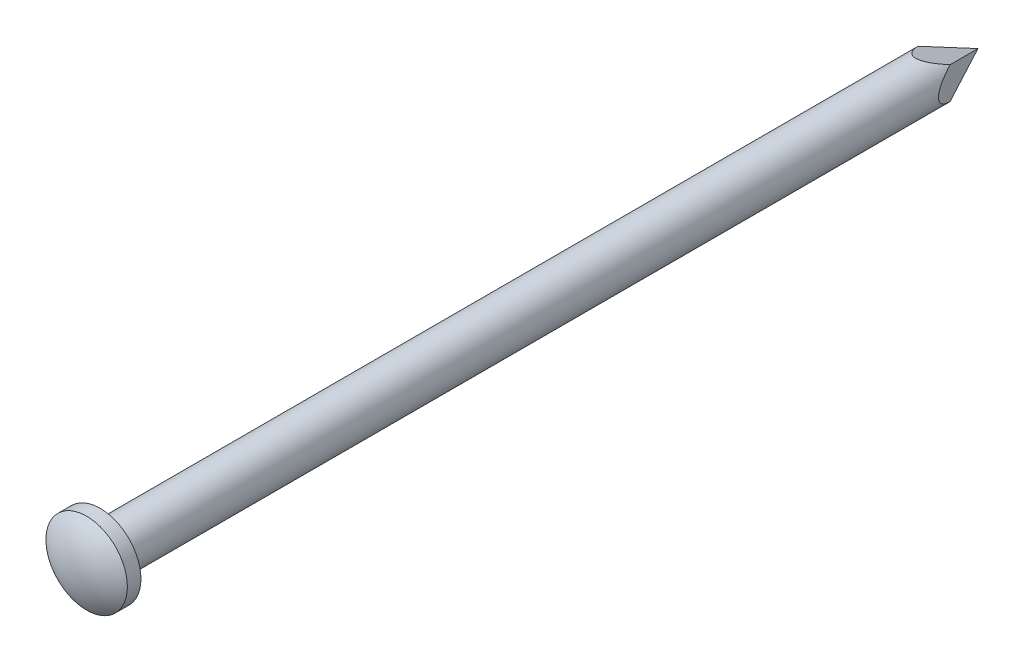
ISO-10303-21;
HEADER;
FILE_DESCRIPTION(('STEP AP214'),'2;1');
FILE_NAME('part.step','',(''),(''),'','','');
FILE_SCHEMA(('AUTOMOTIVE_DESIGN { 1 0 10303 214 1 1 1 1 }'));
ENDSEC;
DATA;
#1=APPLICATION_CONTEXT('core data for automotive mechanical design processes');
#2=APPLICATION_PROTOCOL_DEFINITION('international standard','automotive_design',2000,#1);
#3=PRODUCT_CONTEXT('',#1,'mechanical');
#4=PRODUCT('Part','Part','',(#3));
#5=PRODUCT_RELATED_PRODUCT_CATEGORY('part','',(#4));
#6=PRODUCT_DEFINITION_FORMATION('','',#4);
#7=PRODUCT_DEFINITION_CONTEXT('part definition',#1,'design');
#8=PRODUCT_DEFINITION('design','',#6,#7);
#9=PRODUCT_DEFINITION_SHAPE('','',#8);
#10=(LENGTH_UNIT() NAMED_UNIT(*) SI_UNIT(.MILLI.,.METRE.));
#11=(NAMED_UNIT(*) PLANE_ANGLE_UNIT() SI_UNIT($,.RADIAN.));
#12=(NAMED_UNIT(*) SI_UNIT($,.STERADIAN.) SOLID_ANGLE_UNIT());
#13=UNCERTAINTY_MEASURE_WITH_UNIT(LENGTH_MEASURE(1.E-05),#10,'distance_accuracy_value','');
#14=(GEOMETRIC_REPRESENTATION_CONTEXT(3) GLOBAL_UNCERTAINTY_ASSIGNED_CONTEXT((#13)) GLOBAL_UNIT_ASSIGNED_CONTEXT((#10,
#11,#12)) REPRESENTATION_CONTEXT('',''));
#15=CARTESIAN_POINT('',(0.,0.,0.));
#16=DIRECTION('',(0.,0.,1.));
#17=DIRECTION('',(1.,0.,0.));
#18=AXIS2_PLACEMENT_3D('',#15,#16,#17);
#19=CARTESIAN_POINT('',(0.,0.,-48.5));
#20=DIRECTION('',(0.,0.,1.));
#21=DIRECTION('',(1.,0.,0.));
#22=AXIS2_PLACEMENT_3D('',#19,#20,#21);
#23=CYLINDRICAL_SURFACE('',#22,1.25);
#24=CARTESIAN_POINT('',(0.,0.,-48.5));
#25=DIRECTION('',(-0.939692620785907,0.,0.342020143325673));
#26=DIRECTION('',(0.342020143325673,0.,0.939692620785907));
#27=AXIS2_PLACEMENT_3D('',#24,#25,#26);
#28=ELLIPSE('',#27,3.65475550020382,1.25);
#29=CARTESIAN_POINT('',(0.883883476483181,0.883883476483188,-46.0715501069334));
#30=VERTEX_POINT('',#29);
#31=CARTESIAN_POINT('',(0.883883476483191,-0.88388347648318,-46.0715501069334));
#32=VERTEX_POINT('',#31);
#33=EDGE_CURVE('E48',#30,#32,#28,.F.);
#34=ORIENTED_EDGE('',*,*,#33,.F.);
#35=CARTESIAN_POINT('',(0.,0.,-48.5));
#36=DIRECTION('',(0.,-0.939692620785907,0.342020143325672));
#37=DIRECTION('',(0.,0.342020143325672,0.939692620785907));
#38=AXIS2_PLACEMENT_3D('',#35,#36,#37);
#39=ELLIPSE('',#38,3.65475550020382,1.25);
#40=CARTESIAN_POINT('',(-0.883883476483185,0.883883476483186,-46.0715501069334));
#41=VERTEX_POINT('',#40);
#42=EDGE_CURVE('E76',#41,#30,#39,.F.);
#43=ORIENTED_EDGE('',*,*,#42,.F.);
#44=CARTESIAN_POINT('',(0.,0.,-48.5));
#45=DIRECTION('',(0.939692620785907,0.,0.342020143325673));
#46=DIRECTION('',(-0.342020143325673,0.,0.939692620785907));
#47=AXIS2_PLACEMENT_3D('',#44,#45,#46);
#48=ELLIPSE('',#47,3.65475550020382,1.25);
#49=CARTESIAN_POINT('',(-0.883883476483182,-0.883883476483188,-46.0715501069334));
#50=VERTEX_POINT('',#49);
#51=EDGE_CURVE('E56',#50,#41,#48,.F.);
#52=ORIENTED_EDGE('',*,*,#51,.F.);
#53=CARTESIAN_POINT('',(0.,0.,-48.5));
#54=DIRECTION('',(0.,0.939692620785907,0.342020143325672));
#55=DIRECTION('',(0.,-0.342020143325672,0.939692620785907));
#56=AXIS2_PLACEMENT_3D('',#53,#54,#55);
#57=ELLIPSE('',#56,3.65475550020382,1.25);
#58=EDGE_CURVE('E81',#32,#50,#57,.F.);
#59=ORIENTED_EDGE('',*,*,#58,.F.);
#60=EDGE_LOOP('',(#34,#43,#52,#59));
#61=FACE_BOUND('',#60,.T.);
#62=CARTESIAN_POINT('',(0.,0.,0.));
#63=DIRECTION('',(0.,0.,1.));
#64=DIRECTION('',(1.,0.,0.));
#65=AXIS2_PLACEMENT_3D('',#62,#63,#64);
#66=CIRCLE('',#65,1.25);
#67=CARTESIAN_POINT('',(1.25,0.,0.));
#68=VERTEX_POINT('',#67);
#69=EDGE_CURVE('E41',#68,#68,#66,.T.);
#70=ORIENTED_EDGE('',*,*,#69,.F.);
#71=EDGE_LOOP('',(#70));
#72=FACE_BOUND('',#71,.T.);
#73=ADVANCED_FACE('F33',(#61,#72),#23,.T.);
#74=CARTESIAN_POINT('',(0.,0.,0.75));
#75=DIRECTION('',(0.,0.,-1.));
#76=DIRECTION('',(-1.,0.,0.));
#77=AXIS2_PLACEMENT_3D('',#74,#75,#76);
#78=CYLINDRICAL_SURFACE('',#77,2.25);
#79=CARTESIAN_POINT('',(0.,0.,0.75));
#80=DIRECTION('',(0.,0.,1.));
#81=DIRECTION('',(1.,0.,0.));
#82=AXIS2_PLACEMENT_3D('',#79,#80,#81);
#83=CIRCLE('',#82,2.25);
#84=CARTESIAN_POINT('',(2.25,0.,0.75));
#85=VERTEX_POINT('',#84);
#86=EDGE_CURVE('E92',#85,#85,#83,.T.);
#87=ORIENTED_EDGE('',*,*,#86,.F.);
#88=EDGE_LOOP('',(#87));
#89=FACE_BOUND('',#88,.T.);
#90=CARTESIAN_POINT('',(0.,0.,0.));
#91=DIRECTION('',(0.,0.,1.));
#92=DIRECTION('',(1.,0.,0.));
#93=AXIS2_PLACEMENT_3D('',#90,#91,#92);
#94=CIRCLE('',#93,2.25);
#95=CARTESIAN_POINT('',(2.25,0.,0.));
#96=VERTEX_POINT('',#95);
#97=EDGE_CURVE('E89',#96,#96,#94,.T.);
#98=ORIENTED_EDGE('',*,*,#97,.T.);
#99=EDGE_LOOP('',(#98));
#100=FACE_BOUND('',#99,.T.);
#101=ADVANCED_FACE('F98',(#89,#100),#78,.T.);
#102=CARTESIAN_POINT('',(0.,0.,-2.25));
#103=DIRECTION('',(0.,0.,1.));
#104=DIRECTION('',(1.,0.,0.));
#105=AXIS2_PLACEMENT_3D('',#102,#103,#104);
#106=SPHERICAL_SURFACE('',#105,3.75);
#107=ORIENTED_EDGE('',*,*,#86,.T.);
#108=EDGE_LOOP('',(#107));
#109=FACE_BOUND('',#108,.T.);
#110=ADVANCED_FACE('F35',(#109),#106,.T.);
#111=CARTESIAN_POINT('',(0.,0.,0.));
#112=DIRECTION('',(0.,0.,1.));
#113=DIRECTION('',(1.,0.,0.));
#114=AXIS2_PLACEMENT_3D('',#111,#112,#113);
#115=PLANE('',#114);
#116=ORIENTED_EDGE('',*,*,#69,.T.);
#117=EDGE_LOOP('',(#116));
#118=FACE_BOUND('',#117,.T.);
#119=ORIENTED_EDGE('',*,*,#97,.F.);
#120=EDGE_LOOP('',(#119));
#121=FACE_BOUND('',#120,.T.);
#122=ADVANCED_FACE('F104',(#118,#121),#115,.F.);
#123=CARTESIAN_POINT('',(-2.5,1.25,-45.0656532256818));
#124=DIRECTION('',(0.,-0.939692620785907,0.342020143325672));
#125=DIRECTION('',(0.,-0.342020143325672,-0.939692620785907));
#126=AXIS2_PLACEMENT_3D('',#123,#124,#125);
#127=PLANE('',#126);
#128=ORIENTED_EDGE('',*,*,#42,.T.);
#129=DIRECTION('',(-0.323615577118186,-0.323615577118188,-0.889126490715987));
#130=VECTOR('',#129,1.);
#131=CARTESIAN_POINT('',(0.85727359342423,0.857273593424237,-46.1446601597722));
#132=LINE('',#131,#130);
#133=CARTESIAN_POINT('',(0.,0.,-48.5));
#134=VERTEX_POINT('',#133);
#135=EDGE_CURVE('E67',#30,#134,#132,.T.);
#136=ORIENTED_EDGE('',*,*,#135,.T.);
#137=DIRECTION('',(-0.323615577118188,0.323615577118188,0.889126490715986));
#138=VECTOR('',#137,1.);
#139=CARTESIAN_POINT('',(-1.38090880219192,1.38090880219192,-44.7059842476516));
#140=LINE('',#139,#138);
#141=EDGE_CURVE('E74',#134,#41,#140,.T.);
#142=ORIENTED_EDGE('',*,*,#141,.T.);
#143=EDGE_LOOP('',(#128,#136,#142));
#144=FACE_BOUND('',#143,.T.);
#145=ADVANCED_FACE('F73',(#144),#127,.F.);
#146=CARTESIAN_POINT('',(2.50000000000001,-1.24999999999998,-45.0656532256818));
#147=DIRECTION('',(0.,0.939692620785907,0.342020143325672));
#148=DIRECTION('',(0.,-0.342020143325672,0.939692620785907));
#149=AXIS2_PLACEMENT_3D('',#146,#147,#148);
#150=PLANE('',#149);
#151=DIRECTION('',(0.323615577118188,0.32361557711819,-0.889126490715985));
#152=VECTOR('',#151,1.);
#153=CARTESIAN_POINT('',(-0.85727359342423,-0.857273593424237,-46.1446601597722));
#154=LINE('',#153,#152);
#155=EDGE_CURVE('E11',#50,#134,#154,.T.);
#156=ORIENTED_EDGE('',*,*,#155,.T.);
#157=DIRECTION('',(0.32361557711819,-0.323615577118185,0.889126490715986));
#158=VECTOR('',#157,1.);
#159=CARTESIAN_POINT('',(1.38090880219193,-1.38090880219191,-44.7059842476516));
#160=LINE('',#159,#158);
#161=EDGE_CURVE('E64',#134,#32,#160,.T.);
#162=ORIENTED_EDGE('',*,*,#161,.T.);
#163=ORIENTED_EDGE('',*,*,#58,.T.);
#164=EDGE_LOOP('',(#156,#162,#163));
#165=FACE_BOUND('',#164,.T.);
#166=ADVANCED_FACE('F80',(#165),#150,.F.);
#167=CARTESIAN_POINT('',(-1.25,-2.5,-45.0656532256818));
#168=DIRECTION('',(0.939692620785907,0.,0.342020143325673));
#169=DIRECTION('',(0.342020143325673,0.,-0.939692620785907));
#170=AXIS2_PLACEMENT_3D('',#167,#168,#169);
#171=PLANE('',#170);
#172=ORIENTED_EDGE('',*,*,#51,.T.);
#173=ORIENTED_EDGE('',*,*,#141,.F.);
#174=ORIENTED_EDGE('',*,*,#155,.F.);
#175=EDGE_LOOP('',(#172,#173,#174));
#176=FACE_BOUND('',#175,.T.);
#177=ADVANCED_FACE('F78',(#176),#171,.F.);
#178=CARTESIAN_POINT('',(1.24999999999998,2.50000000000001,-45.0656532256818));
#179=DIRECTION('',(-0.939692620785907,0.,0.342020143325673));
#180=DIRECTION('',(0.342020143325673,0.,0.939692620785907));
#181=AXIS2_PLACEMENT_3D('',#178,#179,#180);
#182=PLANE('',#181);
#183=ORIENTED_EDGE('',*,*,#33,.T.);
#184=ORIENTED_EDGE('',*,*,#161,.F.);
#185=ORIENTED_EDGE('',*,*,#135,.F.);
#186=EDGE_LOOP('',(#183,#184,#185));
#187=FACE_BOUND('',#186,.T.);
#188=ADVANCED_FACE('F66',(#187),#182,.F.);
#189=CLOSED_SHELL('',(#73,#101,#110,#122,#145,#166,#177,#188));
#190=MANIFOLD_SOLID_BREP('B2',#189);
#191=ADVANCED_BREP_SHAPE_REPRESENTATION('',(#18,#190),#14);
#192=SHAPE_DEFINITION_REPRESENTATION(#9,#191);
ENDSEC;
END-ISO-10303-21;
